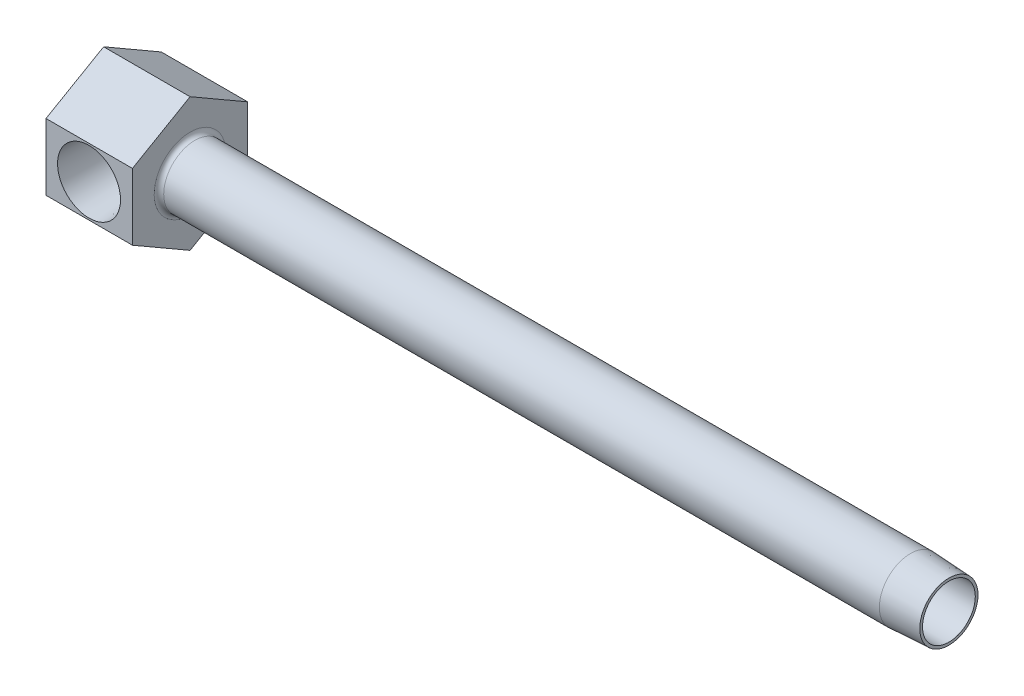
ISO-10303-21;
HEADER;
FILE_DESCRIPTION(('STEP AP214'),'2;1');
FILE_NAME('part.step','',(''),(''),'','','');
FILE_SCHEMA(('AUTOMOTIVE_DESIGN { 1 0 10303 214 1 1 1 1 }'));
ENDSEC;
DATA;
#1=APPLICATION_CONTEXT('core data for automotive mechanical design processes');
#2=APPLICATION_PROTOCOL_DEFINITION('international standard','automotive_design',2000,#1);
#3=PRODUCT_CONTEXT('',#1,'mechanical');
#4=PRODUCT('Part','Part','',(#3));
#5=PRODUCT_RELATED_PRODUCT_CATEGORY('part','',(#4));
#6=PRODUCT_DEFINITION_FORMATION('','',#4);
#7=PRODUCT_DEFINITION_CONTEXT('part definition',#1,'design');
#8=PRODUCT_DEFINITION('design','',#6,#7);
#9=PRODUCT_DEFINITION_SHAPE('','',#8);
#10=(LENGTH_UNIT() NAMED_UNIT(*) SI_UNIT(.MILLI.,.METRE.));
#11=(NAMED_UNIT(*) PLANE_ANGLE_UNIT() SI_UNIT($,.RADIAN.));
#12=(NAMED_UNIT(*) SI_UNIT($,.STERADIAN.) SOLID_ANGLE_UNIT());
#13=UNCERTAINTY_MEASURE_WITH_UNIT(LENGTH_MEASURE(1.E-05),#10,'distance_accuracy_value','');
#14=(GEOMETRIC_REPRESENTATION_CONTEXT(3) GLOBAL_UNCERTAINTY_ASSIGNED_CONTEXT((#13)) GLOBAL_UNIT_ASSIGNED_CONTEXT((#10,
#11,#12)) REPRESENTATION_CONTEXT('',''));
#15=CARTESIAN_POINT('',(0.,0.,0.));
#16=DIRECTION('',(0.,0.,1.));
#17=DIRECTION('',(1.,0.,0.));
#18=AXIS2_PLACEMENT_3D('',#15,#16,#17);
#19=CARTESIAN_POINT('',(7.14375,0.,9.525));
#20=DIRECTION('',(1.,0.,0.));
#21=DIRECTION('',(0.,0.,-1.));
#22=AXIS2_PLACEMENT_3D('',#19,#20,#21);
#23=PLANE('',#22);
#24=DIRECTION('',(0.,0.,1.));
#25=VECTOR('',#24,1.);
#26=CARTESIAN_POINT('',(7.14375,4.21628045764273,19.05));
#27=LINE('',#26,#25);
#28=CARTESIAN_POINT('',(7.14375,4.21628045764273,8.39289543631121));
#29=VERTEX_POINT('',#28);
#30=CARTESIAN_POINT('',(7.14375,4.21628045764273,10.16));
#31=VERTEX_POINT('',#30);
#32=EDGE_CURVE('E280',#29,#31,#27,.T.);
#33=ORIENTED_EDGE('',*,*,#32,.F.);
#34=CARTESIAN_POINT('',(7.14375,0.,9.525));
#35=DIRECTION('',(1.,0.,0.));
#36=DIRECTION('',(0.,0.,-1.));
#37=AXIS2_PLACEMENT_3D('',#34,#35,#36);
#38=CIRCLE('',#37,4.365625);
#39=CARTESIAN_POINT('',(7.14375,4.31919629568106,10.16));
#40=VERTEX_POINT('',#39);
#41=EDGE_CURVE('E163',#29,#40,#38,.T.);
#42=ORIENTED_EDGE('',*,*,#41,.T.);
#43=DIRECTION('',(0.,1.,0.));
#44=VECTOR('',#43,1.);
#45=CARTESIAN_POINT('',(7.14375,0.,10.16));
#46=LINE('',#45,#44);
#47=EDGE_CURVE('E153',#31,#40,#46,.T.);
#48=ORIENTED_EDGE('',*,*,#47,.F.);
#49=EDGE_LOOP('',(#33,#42,#48));
#50=FACE_BOUND('',#49,.T.);
#51=ADVANCED_FACE('F15',(#50),#23,.T.);
#52=CARTESIAN_POINT('',(14.2875,5.4992613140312,19.05));
#53=DIRECTION('',(0.,0.,-1.));
#54=DIRECTION('',(-1.,0.,0.));
#55=AXIS2_PLACEMENT_3D('',#52,#53,#54);
#56=PLANE('',#55);
#57=CARTESIAN_POINT('',(7.112,0.,19.05));
#58=DIRECTION('',(0.,0.,1.));
#59=DIRECTION('',(1.,0.,0.));
#60=AXIS2_PLACEMENT_3D('',#57,#58,#59);
#61=CIRCLE('',#60,5.2023645);
#62=CARTESIAN_POINT('',(12.3143645,0.,19.05));
#63=VERTEX_POINT('',#62);
#64=EDGE_CURVE('E269',#63,#63,#61,.T.);
#65=ORIENTED_EDGE('',*,*,#64,.F.);
#66=EDGE_LOOP('',(#65));
#67=FACE_BOUND('',#66,.T.);
#68=DIRECTION('',(0.,-1.,0.));
#69=VECTOR('',#68,1.);
#70=CARTESIAN_POINT('',(0.,5.4992613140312,19.05));
#71=LINE('',#70,#69);
#72=CARTESIAN_POINT('',(0.,5.4992613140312,19.05));
#73=VERTEX_POINT('',#72);
#74=CARTESIAN_POINT('',(0.,-5.49926131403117,19.05));
#75=VERTEX_POINT('',#74);
#76=EDGE_CURVE('E178',#73,#75,#71,.T.);
#77=ORIENTED_EDGE('',*,*,#76,.T.);
#78=DIRECTION('',(-1.,0.,0.));
#79=VECTOR('',#78,1.);
#80=CARTESIAN_POINT('',(14.2875,-5.49926131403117,19.05));
#81=LINE('',#80,#79);
#82=CARTESIAN_POINT('',(14.2875,-5.49926131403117,19.05));
#83=VERTEX_POINT('',#82);
#84=EDGE_CURVE('E201',#83,#75,#81,.T.);
#85=ORIENTED_EDGE('',*,*,#84,.F.);
#86=DIRECTION('',(0.,-1.,0.));
#87=VECTOR('',#86,1.);
#88=CARTESIAN_POINT('',(14.2875,5.4992613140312,19.05));
#89=LINE('',#88,#87);
#90=CARTESIAN_POINT('',(14.2875,5.4992613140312,19.05));
#91=VERTEX_POINT('',#90);
#92=EDGE_CURVE('E194',#91,#83,#89,.T.);
#93=ORIENTED_EDGE('',*,*,#92,.F.);
#94=DIRECTION('',(-1.,0.,0.));
#95=VECTOR('',#94,1.);
#96=CARTESIAN_POINT('',(14.2875,5.4992613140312,19.05));
#97=LINE('',#96,#95);
#98=EDGE_CURVE('E204',#91,#73,#97,.T.);
#99=ORIENTED_EDGE('',*,*,#98,.T.);
#100=EDGE_LOOP('',(#77,#85,#93,#99));
#101=FACE_BOUND('',#100,.T.);
#102=ADVANCED_FACE('F119',(#67,#101),#56,.F.);
#103=CARTESIAN_POINT('',(14.2875,-5.49926131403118,0.));
#104=DIRECTION('',(1.,0.,0.));
#105=DIRECTION('',(0.,1.,0.));
#106=AXIS2_PLACEMENT_3D('',#103,#104,#105);
#107=PLANE('',#106);
#108=CARTESIAN_POINT('',(14.2875,0.,9.525));
#109=DIRECTION('',(1.,0.,0.));
#110=DIRECTION('',(0.,1.,0.));
#111=AXIS2_PLACEMENT_3D('',#108,#109,#110);
#112=CIRCLE('',#111,5.9309);
#113=CARTESIAN_POINT('',(14.2875,5.9309,9.525));
#114=VERTEX_POINT('',#113);
#115=EDGE_CURVE('E216',#114,#114,#112,.F.);
#116=ORIENTED_EDGE('',*,*,#115,.T.);
#117=EDGE_LOOP('',(#116));
#118=FACE_BOUND('',#117,.T.);
#119=DIRECTION('',(0.,0.5,-0.866025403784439));
#120=VECTOR('',#119,1.);
#121=CARTESIAN_POINT('',(14.2875,-10.9985226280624,9.525));
#122=LINE('',#121,#120);
#123=CARTESIAN_POINT('',(14.2875,-10.9985226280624,9.525));
#124=VERTEX_POINT('',#123);
#125=CARTESIAN_POINT('',(14.2875,-5.49926131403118,0.));
#126=VERTEX_POINT('',#125);
#127=EDGE_CURVE('E184',#124,#126,#122,.T.);
#128=ORIENTED_EDGE('',*,*,#127,.T.);
#129=DIRECTION('',(0.,1.,0.));
#130=VECTOR('',#129,1.);
#131=CARTESIAN_POINT('',(14.2875,-5.49926131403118,0.));
#132=LINE('',#131,#130);
#133=CARTESIAN_POINT('',(14.2875,5.49926131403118,0.));
#134=VERTEX_POINT('',#133);
#135=EDGE_CURVE('E188',#126,#134,#132,.T.);
#136=ORIENTED_EDGE('',*,*,#135,.T.);
#137=DIRECTION('',(0.,0.5,0.866025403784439));
#138=VECTOR('',#137,1.);
#139=CARTESIAN_POINT('',(14.2875,5.49926131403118,0.));
#140=LINE('',#139,#138);
#141=CARTESIAN_POINT('',(14.2875,10.9985226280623,9.525));
#142=VERTEX_POINT('',#141);
#143=EDGE_CURVE('E190',#134,#142,#140,.T.);
#144=ORIENTED_EDGE('',*,*,#143,.T.);
#145=DIRECTION('',(0.,-0.5,0.86602540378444));
#146=VECTOR('',#145,1.);
#147=CARTESIAN_POINT('',(14.2875,10.9985226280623,9.525));
#148=LINE('',#147,#146);
#149=EDGE_CURVE('E192',#142,#91,#148,.T.);
#150=ORIENTED_EDGE('',*,*,#149,.T.);
#151=ORIENTED_EDGE('',*,*,#92,.T.);
#152=DIRECTION('',(0.,-0.5,-0.866025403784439));
#153=VECTOR('',#152,1.);
#154=CARTESIAN_POINT('',(14.2875,-5.49926131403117,19.05));
#155=LINE('',#154,#153);
#156=EDGE_CURVE('E38',#83,#124,#155,.T.);
#157=ORIENTED_EDGE('',*,*,#156,.T.);
#158=EDGE_LOOP('',(#128,#136,#144,#150,#151,#157));
#159=FACE_BOUND('',#158,.T.);
#160=ADVANCED_FACE('F127',(#118,#159),#107,.T.);
#161=CARTESIAN_POINT('',(14.2875,-10.9985226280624,9.525));
#162=DIRECTION('',(0.,0.866025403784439,0.5));
#163=DIRECTION('',(0.,-0.5,0.866025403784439));
#164=AXIS2_PLACEMENT_3D('',#161,#162,#163);
#165=PLANE('',#164);
#166=DIRECTION('',(0.,0.5,-0.866025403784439));
#167=VECTOR('',#166,1.);
#168=CARTESIAN_POINT('',(0.,-10.9985226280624,9.525));
#169=LINE('',#168,#167);
#170=CARTESIAN_POINT('',(0.,-10.9985226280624,9.525));
#171=VERTEX_POINT('',#170);
#172=CARTESIAN_POINT('',(0.,-5.49926131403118,0.));
#173=VERTEX_POINT('',#172);
#174=EDGE_CURVE('E166',#171,#173,#169,.T.);
#175=ORIENTED_EDGE('',*,*,#174,.T.);
#176=DIRECTION('',(-1.,0.,0.));
#177=VECTOR('',#176,1.);
#178=CARTESIAN_POINT('',(14.2875,-5.49926131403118,0.));
#179=LINE('',#178,#177);
#180=EDGE_CURVE('E213',#126,#173,#179,.T.);
#181=ORIENTED_EDGE('',*,*,#180,.F.);
#182=ORIENTED_EDGE('',*,*,#127,.F.);
#183=DIRECTION('',(-1.,0.,0.));
#184=VECTOR('',#183,1.);
#185=CARTESIAN_POINT('',(14.2875,-10.9985226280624,9.525));
#186=LINE('',#185,#184);
#187=EDGE_CURVE('E197',#124,#171,#186,.T.);
#188=ORIENTED_EDGE('',*,*,#187,.T.);
#189=EDGE_LOOP('',(#175,#181,#182,#188));
#190=FACE_BOUND('',#189,.T.);
#191=ADVANCED_FACE('F301',(#190),#165,.F.);
#192=CARTESIAN_POINT('',(14.2875,-5.49926131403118,0.));
#193=DIRECTION('',(0.,0.,1.));
#194=DIRECTION('',(0.,-1.,0.));
#195=AXIS2_PLACEMENT_3D('',#192,#193,#194);
#196=PLANE('',#195);
#197=DIRECTION('',(0.,1.,0.));
#198=VECTOR('',#197,1.);
#199=CARTESIAN_POINT('',(0.,-5.49926131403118,0.));
#200=LINE('',#199,#198);
#201=CARTESIAN_POINT('',(0.,5.49926131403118,0.));
#202=VERTEX_POINT('',#201);
#203=EDGE_CURVE('E169',#173,#202,#200,.T.);
#204=ORIENTED_EDGE('',*,*,#203,.T.);
#205=DIRECTION('',(-1.,0.,0.));
#206=VECTOR('',#205,1.);
#207=CARTESIAN_POINT('',(14.2875,5.49926131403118,0.));
#208=LINE('',#207,#206);
#209=EDGE_CURVE('E210',#134,#202,#208,.T.);
#210=ORIENTED_EDGE('',*,*,#209,.F.);
#211=ORIENTED_EDGE('',*,*,#135,.F.);
#212=ORIENTED_EDGE('',*,*,#180,.T.);
#213=EDGE_LOOP('',(#204,#210,#211,#212));
#214=FACE_BOUND('',#213,.T.);
#215=ADVANCED_FACE('F307',(#214),#196,.F.);
#216=CARTESIAN_POINT('',(14.2875,5.49926131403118,0.));
#217=DIRECTION('',(0.,-0.866025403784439,0.5));
#218=DIRECTION('',(0.,-0.5,-0.866025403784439));
#219=AXIS2_PLACEMENT_3D('',#216,#217,#218);
#220=PLANE('',#219);
#221=DIRECTION('',(0.,0.5,0.866025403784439));
#222=VECTOR('',#221,1.);
#223=CARTESIAN_POINT('',(0.,5.49926131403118,0.));
#224=LINE('',#223,#222);
#225=CARTESIAN_POINT('',(0.,10.9985226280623,9.525));
#226=VERTEX_POINT('',#225);
#227=EDGE_CURVE('E172',#202,#226,#224,.T.);
#228=ORIENTED_EDGE('',*,*,#227,.T.);
#229=DIRECTION('',(-1.,0.,0.));
#230=VECTOR('',#229,1.);
#231=CARTESIAN_POINT('',(14.2875,10.9985226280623,9.525));
#232=LINE('',#231,#230);
#233=EDGE_CURVE('E207',#142,#226,#232,.T.);
#234=ORIENTED_EDGE('',*,*,#233,.F.);
#235=ORIENTED_EDGE('',*,*,#143,.F.);
#236=ORIENTED_EDGE('',*,*,#209,.T.);
#237=EDGE_LOOP('',(#228,#234,#235,#236));
#238=FACE_BOUND('',#237,.T.);
#239=ADVANCED_FACE('F309',(#238),#220,.F.);
#240=CARTESIAN_POINT('',(14.2875,10.9985226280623,9.525));
#241=DIRECTION('',(0.,-0.86602540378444,-0.5));
#242=DIRECTION('',(0.,0.5,-0.86602540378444));
#243=AXIS2_PLACEMENT_3D('',#240,#241,#242);
#244=PLANE('',#243);
#245=DIRECTION('',(0.,-0.5,0.86602540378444));
#246=VECTOR('',#245,1.);
#247=CARTESIAN_POINT('',(0.,10.9985226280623,9.525));
#248=LINE('',#247,#246);
#249=EDGE_CURVE('E175',#226,#73,#248,.T.);
#250=ORIENTED_EDGE('',*,*,#249,.T.);
#251=ORIENTED_EDGE('',*,*,#98,.F.);
#252=ORIENTED_EDGE('',*,*,#149,.F.);
#253=ORIENTED_EDGE('',*,*,#233,.T.);
#254=EDGE_LOOP('',(#250,#251,#252,#253));
#255=FACE_BOUND('',#254,.T.);
#256=ADVANCED_FACE('F312',(#255),#244,.F.);
#257=CARTESIAN_POINT('',(14.2875,-5.49926131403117,19.05));
#258=DIRECTION('',(0.,0.866025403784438,-0.5));
#259=DIRECTION('',(0.,0.5,0.866025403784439));
#260=AXIS2_PLACEMENT_3D('',#257,#258,#259);
#261=PLANE('',#260);
#262=DIRECTION('',(0.,-0.5,-0.866025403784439));
#263=VECTOR('',#262,1.);
#264=CARTESIAN_POINT('',(0.,-5.49926131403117,19.05));
#265=LINE('',#264,#263);
#266=EDGE_CURVE('E181',#75,#171,#265,.T.);
#267=ORIENTED_EDGE('',*,*,#266,.T.);
#268=ORIENTED_EDGE('',*,*,#187,.F.);
#269=ORIENTED_EDGE('',*,*,#156,.F.);
#270=ORIENTED_EDGE('',*,*,#84,.T.);
#271=EDGE_LOOP('',(#267,#268,#269,#270));
#272=FACE_BOUND('',#271,.T.);
#273=ADVANCED_FACE('F296',(#272),#261,.F.);
#274=CARTESIAN_POINT('',(0.,-5.49926131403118,0.));
#275=DIRECTION('',(1.,0.,0.));
#276=DIRECTION('',(0.,1.,0.));
#277=AXIS2_PLACEMENT_3D('',#274,#275,#276);
#278=PLANE('',#277);
#279=ORIENTED_EDGE('',*,*,#174,.F.);
#280=ORIENTED_EDGE('',*,*,#266,.F.);
#281=ORIENTED_EDGE('',*,*,#76,.F.);
#282=ORIENTED_EDGE('',*,*,#249,.F.);
#283=ORIENTED_EDGE('',*,*,#227,.F.);
#284=ORIENTED_EDGE('',*,*,#203,.F.);
#285=EDGE_LOOP('',(#279,#280,#281,#282,#283,#284));
#286=FACE_BOUND('',#285,.T.);
#287=ADVANCED_FACE('F141',(#286),#278,.F.);
#288=CARTESIAN_POINT('',(68.0114010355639,0.,9.525));
#289=DIRECTION('',(-1.,0.,0.));
#290=DIRECTION('',(0.,0.,1.));
#291=AXIS2_PLACEMENT_3D('',#288,#289,#290);
#292=CYLINDRICAL_SURFACE('',#291,5.1435);
#293=CARTESIAN_POINT('',(133.35,0.,9.525));
#294=DIRECTION('',(-1.,0.,0.));
#295=DIRECTION('',(0.,0.,1.));
#296=AXIS2_PLACEMENT_3D('',#293,#294,#295);
#297=CIRCLE('',#296,5.1435);
#298=CARTESIAN_POINT('',(133.35,0.,14.6685));
#299=VERTEX_POINT('',#298);
#300=EDGE_CURVE('E10',#299,#299,#297,.F.);
#301=ORIENTED_EDGE('',*,*,#300,.F.);
#302=EDGE_LOOP('',(#301));
#303=FACE_BOUND('',#302,.T.);
#304=CARTESIAN_POINT('',(15.0749,0.,9.525));
#305=DIRECTION('',(1.,0.,0.));
#306=DIRECTION('',(0.,1.,0.));
#307=AXIS2_PLACEMENT_3D('',#304,#305,#306);
#308=CIRCLE('',#307,5.1435);
#309=CARTESIAN_POINT('',(15.0749,5.1435,9.525));
#310=VERTEX_POINT('',#309);
#311=EDGE_CURVE('E219',#310,#310,#308,.T.);
#312=ORIENTED_EDGE('',*,*,#311,.T.);
#313=EDGE_LOOP('',(#312));
#314=FACE_BOUND('',#313,.T.);
#315=ADVANCED_FACE('F17',(#303,#314),#292,.T.);
#316=CARTESIAN_POINT('',(7.14375,-4.31919629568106,10.16));
#317=VERTEX_POINT('',#316);
#318=CARTESIAN_POINT('',(7.14375,-4.21628045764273,10.16));
#319=VERTEX_POINT('',#318);
#320=EDGE_CURVE('E146',#317,#319,#46,.T.);
#321=ORIENTED_EDGE('',*,*,#320,.F.);
#322=CARTESIAN_POINT('',(7.14375,-4.21628045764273,8.39289543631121));
#323=VERTEX_POINT('',#322);
#324=EDGE_CURVE('E148',#317,#323,#38,.T.);
#325=ORIENTED_EDGE('',*,*,#324,.T.);
#326=DIRECTION('',(0.,0.,1.));
#327=VECTOR('',#326,1.);
#328=CARTESIAN_POINT('',(7.14375,-4.21628045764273,19.05));
#329=LINE('',#328,#327);
#330=EDGE_CURVE('E149',#319,#323,#329,.F.);
#331=ORIENTED_EDGE('',*,*,#330,.F.);
#332=EDGE_LOOP('',(#321,#325,#331));
#333=FACE_BOUND('',#332,.T.);
#334=ADVANCED_FACE('F122',(#333),#23,.T.);
#335=CARTESIAN_POINT('',(66.1375087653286,0.,9.525));
#336=DIRECTION('',(1.,0.,0.));
#337=DIRECTION('',(0.,0.,-1.));
#338=AXIS2_PLACEMENT_3D('',#335,#336,#337);
#339=CYLINDRICAL_SURFACE('',#338,4.365625);
#340=DIRECTION('',(1.,0.,0.));
#341=VECTOR('',#340,1.);
#342=CARTESIAN_POINT('',(66.1375087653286,4.31919629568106,10.16));
#343=LINE('',#342,#341);
#344=CARTESIAN_POINT('',(9.50166012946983,4.31919629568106,10.16));
#345=VERTEX_POINT('',#344);
#346=EDGE_CURVE('E23',#40,#345,#343,.T.);
#347=ORIENTED_EDGE('',*,*,#346,.F.);
#348=ORIENTED_EDGE('',*,*,#41,.F.);
#349=CARTESIAN_POINT('',(11.0152606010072,1.5945487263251,5.461));
#350=CARTESIAN_POINT('',(10.9690910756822,1.7075595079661,5.50534166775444));
#351=CARTESIAN_POINT('',(10.9186455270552,1.81703423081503,5.55373339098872));
#352=CARTESIAN_POINT('',(10.810302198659,2.02846645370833,5.65746242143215));
#353=CARTESIAN_POINT('',(10.7524192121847,2.13043826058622,5.71278593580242));
#354=CARTESIAN_POINT('',(10.5698905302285,2.42358040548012,5.88682744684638));
#355=CARTESIAN_POINT('',(10.4356317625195,2.6037024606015,6.01432367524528));
#356=CARTESIAN_POINT('',(10.2004726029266,2.87382153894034,6.2358690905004));
#357=CARTESIAN_POINT('',(10.1051285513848,2.97281573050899,6.32528321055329));
#358=CARTESIAN_POINT('',(9.90783434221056,3.15907014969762,6.50903483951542));
#359=CARTESIAN_POINT('',(9.80588273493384,3.2463277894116,6.60337342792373));
#360=CARTESIAN_POINT('',(9.59613587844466,3.40951469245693,6.79556583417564));
#361=CARTESIAN_POINT('',(9.48833347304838,3.48542963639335,6.89342390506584));
#362=CARTESIAN_POINT('',(9.26745878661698,3.62617881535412,7.09103053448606));
#363=CARTESIAN_POINT('',(9.15438825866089,3.69101670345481,7.19077845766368));
#364=CARTESIAN_POINT('',(8.91700112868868,3.81296593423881,7.39547820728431));
#365=CARTESIAN_POINT('',(8.79240497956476,3.86952009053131,7.50043788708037));
#366=CARTESIAN_POINT('',(8.53587575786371,3.97111492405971,7.70779573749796));
#367=CARTESIAN_POINT('',(8.40392330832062,4.01612325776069,7.81018600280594));
#368=CARTESIAN_POINT('',(8.16304729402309,4.0847277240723,7.98226690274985));
#369=CARTESIAN_POINT('',(8.0562781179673,4.11086974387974,8.05387458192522));
#370=CARTESIAN_POINT('',(7.89027521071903,4.14432560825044,8.15224503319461));
#371=CARTESIAN_POINT('',(7.83425575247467,4.15448196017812,8.18339689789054));
#372=CARTESIAN_POINT('',(7.71975817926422,4.17277321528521,8.24142733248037));
#373=CARTESIAN_POINT('',(7.6612817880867,4.18090950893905,8.26830883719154));
#374=CARTESIAN_POINT('',(7.52931857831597,4.19631734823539,8.32062856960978));
#375=CARTESIAN_POINT('',(7.45518069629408,4.2030846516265,8.34468558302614));
#376=CARTESIAN_POINT('',(7.30234246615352,4.21282137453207,8.37996487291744));
#377=CARTESIAN_POINT('',(7.22358315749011,4.21571837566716,8.39094201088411));
#378=CARTESIAN_POINT('',(7.14374999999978,4.21628045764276,8.39289543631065));
#379=B_SPLINE_CURVE_WITH_KNOTS('',3,(#349,#350,#351,#352,#353,#354,#355,#356,#357,#358,#359,
#360,#361,#362,#363,#364,#365,#366,#367,#368,#369,#370,#371,#372,#373,#374,#375,#376,#377,#378),
.UNSPECIFIED.,.F.,.F.,(4,2,2,2,2,2,2,2,2,2,2,2,2,2,4),(0.,0.389178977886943,0.777595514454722,
1.54850925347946,2.03989074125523,2.5313804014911,3.02348538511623,3.51542776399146,
4.03226982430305,4.5505442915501,4.94339994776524,5.13792303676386,5.33231185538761,
5.56585330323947,5.80370611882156),.UNSPECIFIED.);
#380=CARTESIAN_POINT('',(11.0152606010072,1.5945487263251,5.461));
#381=VERTEX_POINT('',#380);
#382=EDGE_CURVE('E222',#381,#29,#379,.T.);
#383=ORIENTED_EDGE('',*,*,#382,.F.);
#384=CARTESIAN_POINT('',(11.038608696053,-1.66986531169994,5.4913625));
#385=CARTESIAN_POINT('',(11.0105354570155,-1.5831922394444,5.45544731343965));
#386=CARTESIAN_POINT('',(10.985979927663,-1.49442111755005,5.422003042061));
#387=CARTESIAN_POINT('',(10.9431209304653,-1.31365154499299,5.36062405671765));
#388=CARTESIAN_POINT('',(10.9248095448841,-1.22165734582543,5.3326823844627));
#389=CARTESIAN_POINT('',(10.8936059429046,-1.03529168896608,5.28281066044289));
#390=CARTESIAN_POINT('',(10.8807075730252,-0.94092306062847,5.26087379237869));
#391=CARTESIAN_POINT('',(10.8594086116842,-0.750424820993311,5.22325970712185));
#392=CARTESIAN_POINT('',(10.8510094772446,-0.654294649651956,5.20758451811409));
#393=CARTESIAN_POINT('',(10.8381415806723,-0.463156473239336,5.18296779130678));
#394=CARTESIAN_POINT('',(10.8335877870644,-0.368172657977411,5.1738812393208));
#395=CARTESIAN_POINT('',(10.8276558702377,-0.177678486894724,5.16194794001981));
#396=CARTESIAN_POINT('',(10.8262790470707,-0.0821679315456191,5.15910374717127));
#397=CARTESIAN_POINT('',(10.826564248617,0.108822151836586,5.15968693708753));
#398=CARTESIAN_POINT('',(10.828226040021,0.204301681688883,5.16311383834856));
#399=CARTESIAN_POINT('',(10.8347557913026,0.3946850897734,5.17620642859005));
#400=CARTESIAN_POINT('',(10.8396224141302,0.489589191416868,5.18586951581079));
#401=CARTESIAN_POINT('',(10.8530224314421,0.678329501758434,5.2113452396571));
#402=CARTESIAN_POINT('',(10.861556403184,0.772165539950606,5.22715884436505));
#403=CARTESIAN_POINT('',(10.882977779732,0.958108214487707,5.26475262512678));
#404=CARTESIAN_POINT('',(10.8958637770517,1.05021539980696,5.28653087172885));
#405=CARTESIAN_POINT('',(10.9268394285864,1.23213175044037,5.33579934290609));
#406=CARTESIAN_POINT('',(10.9449350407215,1.32193815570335,5.36329609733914));
#407=CARTESIAN_POINT('',(10.9870994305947,1.49845562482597,5.42352620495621));
#408=CARTESIAN_POINT('',(11.0111754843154,1.58516276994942,5.45626591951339));
#409=CARTESIAN_POINT('',(11.038608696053,1.66986531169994,5.4913625));
#410=B_SPLINE_CURVE_WITH_KNOTS('',3,(#384,#385,#386,#387,#388,#389,#390,#391,#392,#393,#394,
#395,#396,#397,#398,#399,#400,#401,#402,#403,#404,#405,#406,#407,#408,#409),.UNSPECIFIED.,.F.,
.F.,(4,2,2,2,2,2,2,2,2,2,2,2,4),(0.,0.293591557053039,0.586809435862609,0.879693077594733,
1.17267150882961,1.45898777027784,1.74542117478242,2.03183258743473,2.31812458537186,
2.60446166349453,2.89070622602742,3.17727945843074,3.46420306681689),.UNSPECIFIED.);
#411=CARTESIAN_POINT('',(11.0152606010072,-1.5945487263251,5.461));
#412=VERTEX_POINT('',#411);
#413=EDGE_CURVE('E227',#412,#381,#410,.T.);
#414=ORIENTED_EDGE('',*,*,#413,.F.);
#415=CARTESIAN_POINT('',(7.14375,-4.21628045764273,8.39289543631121));
#416=CARTESIAN_POINT('',(7.18362399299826,-4.21598583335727,8.39181806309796));
#417=CARTESIAN_POINT('',(7.22338201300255,-4.21511517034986,8.38855660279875));
#418=CARTESIAN_POINT('',(7.30220974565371,-4.21229002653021,8.3781194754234));
#419=CARTESIAN_POINT('',(7.34128135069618,-4.21033927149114,8.37095726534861));
#420=CARTESIAN_POINT('',(7.45558593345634,-4.20306181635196,8.34463096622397));
#421=CARTESIAN_POINT('',(7.52959005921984,-4.19629141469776,8.32054287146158));
#422=CARTESIAN_POINT('',(7.67793141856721,-4.17895935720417,8.2616842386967));
#423=CARTESIAN_POINT('',(7.75200183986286,-4.16818767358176,8.22634138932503));
#424=CARTESIAN_POINT('',(7.89635080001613,-4.14345087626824,8.14945009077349));
#425=CARTESIAN_POINT('',(7.96662283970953,-4.12948049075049,8.10789143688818));
#426=CARTESIAN_POINT('',(8.10525974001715,-4.09836535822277,8.02024615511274));
#427=CARTESIAN_POINT('',(8.17357097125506,-4.08117012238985,7.97409391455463));
#428=CARTESIAN_POINT('',(8.30769836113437,-4.04390532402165,7.87936489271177));
#429=CARTESIAN_POINT('',(8.37351346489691,-4.02383456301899,7.83078710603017));
#430=CARTESIAN_POINT('',(8.57859672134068,-3.95588469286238,7.67482924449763));
#431=CARTESIAN_POINT('',(8.71418056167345,-3.90283307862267,7.56482866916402));
#432=CARTESIAN_POINT('',(8.97841531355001,-3.78358080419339,7.34346052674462));
#433=CARTESIAN_POINT('',(9.10705932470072,-3.71736735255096,7.23209172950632));
#434=CARTESIAN_POINT('',(9.35705912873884,-3.57190642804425,7.01153592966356));
#435=CARTESIAN_POINT('',(9.47845600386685,-3.49274436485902,6.90233956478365));
#436=CARTESIAN_POINT('',(9.71438396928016,-3.32067953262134,6.68762551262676));
#437=CARTESIAN_POINT('',(9.82891987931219,-3.22778657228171,6.58210526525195));
#438=CARTESIAN_POINT('',(10.0969445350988,-2.98549279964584,6.33327532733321));
#439=CARTESIAN_POINT('',(10.2465325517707,-2.82876640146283,6.19275827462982));
#440=CARTESIAN_POINT('',(10.5251240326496,-2.48539491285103,5.92944140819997));
#441=CARTESIAN_POINT('',(10.6541872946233,-2.29884003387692,5.80659022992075));
#442=CARTESIAN_POINT('',(10.815064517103,-2.01834728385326,5.65289947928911));
#443=CARTESIAN_POINT('',(10.8584525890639,-1.93670806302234,5.61137999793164));
#444=CARTESIAN_POINT('',(10.9405236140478,-1.76894321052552,5.53274400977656));
#445=CARTESIAN_POINT('',(10.9792015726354,-1.6828129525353,5.49563217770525));
#446=CARTESIAN_POINT('',(11.0152606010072,-1.5945487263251,5.461));
#447=B_SPLINE_CURVE_WITH_KNOTS('',3,(#415,#416,#417,#418,#419,#420,#421,#422,#423,#424,#425,
#426,#427,#428,#429,#430,#431,#432,#433,#434,#435,#436,#437,#438,#439,#440,#441,#442,#443,#444,
#445,#446),.UNSPECIFIED.,.F.,.F.,(4,2,2,2,2,2,2,2,2,2,2,2,2,2,2,4),(0.,0.119524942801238,
0.238640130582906,0.471907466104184,0.719716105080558,0.967936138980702,1.2204276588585,
1.47302472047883,2.01967972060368,2.56686861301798,3.1105838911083,3.65391262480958,
4.4259772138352,5.19574951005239,5.49953103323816,5.80363192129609),.UNSPECIFIED.);
#448=EDGE_CURVE('E162',#323,#412,#447,.T.);
#449=ORIENTED_EDGE('',*,*,#448,.F.);
#450=ORIENTED_EDGE('',*,*,#324,.F.);
#451=DIRECTION('',(1.,0.,0.));
#452=VECTOR('',#451,1.);
#453=CARTESIAN_POINT('',(66.1375087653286,-4.31919629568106,10.16));
#454=LINE('',#453,#452);
#455=CARTESIAN_POINT('',(9.50166012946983,-4.31919629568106,10.16));
#456=VERTEX_POINT('',#455);
#457=EDGE_CURVE('E160',#456,#317,#454,.F.);
#458=ORIENTED_EDGE('',*,*,#457,.F.);
#459=CARTESIAN_POINT('',(9.50159462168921,4.31922569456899,10.1598));
#460=CARTESIAN_POINT('',(9.52205476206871,4.31004461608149,10.2222542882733));
#461=CARTESIAN_POINT('',(9.54440879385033,4.29961032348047,10.2838517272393));
#462=CARTESIAN_POINT('',(9.592244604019,4.27639816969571,10.4052958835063));
#463=CARTESIAN_POINT('',(9.61772301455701,4.26362282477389,10.4651444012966));
#464=CARTESIAN_POINT('',(9.6977084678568,4.22211002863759,10.641720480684));
#465=CARTESIAN_POINT('',(9.75594525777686,4.19010742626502,10.7559937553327));
#466=CARTESIAN_POINT('',(9.87844694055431,4.11827910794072,10.9783012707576));
#467=CARTESIAN_POINT('',(9.94270165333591,4.07846648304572,11.0863455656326));
#468=CARTESIAN_POINT('',(10.0748723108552,3.9913538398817,11.2972300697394));
#469=CARTESIAN_POINT('',(10.1427929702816,3.94404402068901,11.4000632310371));
#470=CARTESIAN_POINT('',(10.298774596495,3.82856370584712,11.6276502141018));
#471=CARTESIAN_POINT('',(10.3873705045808,3.75819622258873,11.7509249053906));
#472=CARTESIAN_POINT('',(10.5646676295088,3.60591330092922,11.9899830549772));
#473=CARTESIAN_POINT('',(10.6533688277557,3.52399966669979,12.1057676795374));
#474=CARTESIAN_POINT('',(10.828903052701,3.34837324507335,12.3298815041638));
#475=CARTESIAN_POINT('',(10.9157338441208,3.25464716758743,12.4382020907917));
#476=CARTESIAN_POINT('',(11.0854790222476,3.05533823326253,12.6465978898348));
#477=CARTESIAN_POINT('',(11.1683947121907,2.94975936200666,12.746675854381));
#478=CARTESIAN_POINT('',(11.3637298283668,2.67738871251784,12.9797077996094));
#479=CARTESIAN_POINT('',(11.4730979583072,2.50408908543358,13.1077769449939));
#480=CARTESIAN_POINT('',(11.6736784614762,2.13317678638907,13.3402290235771));
#481=CARTESIAN_POINT('',(11.764930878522,1.93561933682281,13.444664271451));
#482=CARTESIAN_POINT('',(11.9092563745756,1.55445058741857,13.608817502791));
#483=CARTESIAN_POINT('',(11.9662034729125,1.37434002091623,13.6731460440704));
#484=CARTESIAN_POINT('',(12.036275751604,1.09545803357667,13.7520594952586));
#485=CARTESIAN_POINT('',(12.0570798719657,1.00100886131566,13.7754393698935));
#486=CARTESIAN_POINT('',(12.093196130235,0.80976989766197,13.8159777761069));
#487=CARTESIAN_POINT('',(12.1085105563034,0.712981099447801,13.8331388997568));
#488=CARTESIAN_POINT('',(12.1334016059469,0.517219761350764,13.861011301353));
#489=CARTESIAN_POINT('',(12.1429475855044,0.418238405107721,13.8716881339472));
#490=CARTESIAN_POINT('',(12.1559671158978,0.219418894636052,13.8862461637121));
#491=CARTESIAN_POINT('',(12.159443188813,0.119581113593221,13.8901301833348));
#492=CARTESIAN_POINT('',(12.1602489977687,-0.0801622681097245,13.8910308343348));
#493=CARTESIAN_POINT('',(12.157578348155,-0.180067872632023,13.8880470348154));
#494=CARTESIAN_POINT('',(12.1461610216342,-0.379063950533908,13.87528173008));
#495=CARTESIAN_POINT('',(12.1374146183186,-0.478154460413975,13.8655005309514));
#496=CARTESIAN_POINT('',(12.1041501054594,-0.757548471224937,13.8282625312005));
#497=CARTESIAN_POINT('',(12.0725539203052,-0.936048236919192,13.7928583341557));
#498=CARTESIAN_POINT('',(11.9914510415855,-1.28332325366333,13.701614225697));
#499=CARTESIAN_POINT('',(11.9419389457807,-1.45209555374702,13.645768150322));
#500=CARTESIAN_POINT('',(11.8234161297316,-1.78986703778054,13.5113020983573));
#501=CARTESIAN_POINT('',(11.7531886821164,-1.95786359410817,13.4312490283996));
#502=CARTESIAN_POINT('',(11.5990616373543,-2.2774775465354,13.2539727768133));
#503=CARTESIAN_POINT('',(11.515160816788,-2.42909347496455,13.1567480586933));
#504=CARTESIAN_POINT('',(11.2893838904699,-2.79222476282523,12.8919364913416));
#505=CARTESIAN_POINT('',(11.1405152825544,-2.99235864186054,12.7145443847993));
#506=CARTESIAN_POINT('',(10.9077049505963,-3.26312100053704,12.4281267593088));
#507=CARTESIAN_POINT('',(10.8282461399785,-3.34869576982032,12.3289140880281));
#508=CARTESIAN_POINT('',(10.6676325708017,-3.51003537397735,12.1240974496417));
#509=CARTESIAN_POINT('',(10.5864785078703,-3.58580414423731,12.0184960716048));
#510=CARTESIAN_POINT('',(10.4220303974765,-3.72941202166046,11.798300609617));
#511=CARTESIAN_POINT('',(10.338734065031,-3.79700254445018,11.6835467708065));
#512=CARTESIAN_POINT('',(10.1740816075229,-3.92201333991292,11.4470806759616));
#513=CARTESIAN_POINT('',(10.092727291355,-3.97942442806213,11.3253622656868));
#514=CARTESIAN_POINT('',(9.93568225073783,-4.08324264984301,11.0754774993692));
#515=CARTESIAN_POINT('',(9.85994825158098,-4.12974154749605,10.9473767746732));
#516=CARTESIAN_POINT('',(9.71779756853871,-4.21155620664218,10.6828322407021));
#517=CARTESIAN_POINT('',(9.65135922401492,-4.24689821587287,10.5464089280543));
#518=CARTESIAN_POINT('',(9.57628126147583,-4.28419371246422,10.3652627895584));
#519=CARTESIAN_POINT('',(9.56028735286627,-4.29194911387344,10.3247361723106));
#520=CARTESIAN_POINT('',(9.52977406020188,-4.30640007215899,10.2428664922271));
#521=CARTESIAN_POINT('',(9.51525722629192,-4.31309380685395,10.2015221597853));
#522=CARTESIAN_POINT('',(9.50159462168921,-4.31922569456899,10.1598));
#523=B_SPLINE_CURVE_WITH_KNOTS('',3,(#459,#460,#461,#462,#463,#464,#465,#466,#467,#468,#469,
#470,#471,#472,#473,#474,#475,#476,#477,#478,#479,#480,#481,#482,#483,#484,#485,#486,#487,#488,
#489,#490,#491,#492,#493,#494,#495,#496,#497,#498,#499,#500,#501,#502,#503,#504,#505,#506,#507,
#508,#509,#510,#511,#512,#513,#514,#515,#516,#517,#518,#519,#520,#521,#522),.UNSPECIFIED.,.F.,
.F.,(4,2,2,2,2,2,2,2,2,2,2,2,2,2,2,2,2,2,2,2,2,2,2,2,2,2,2,2,2,2,2,4),(0.,0.19895577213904,
0.397698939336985,0.793542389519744,1.1887279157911,1.58443438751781,2.08580736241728,
2.58710208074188,3.08896592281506,3.5906615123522,4.3128774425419,5.03347872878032,
5.62940645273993,5.92758657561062,6.22564226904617,6.52526772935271,6.82476866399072,
7.12428839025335,7.4237946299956,7.97525228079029,8.52687635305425,9.12138980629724,
9.71595648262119,10.6287987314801,11.0881817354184,11.5473798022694,12.018174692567,
12.4893922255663,12.9564924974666,13.4224855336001,13.5552077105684,13.6881552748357),.UNSPECIFIED.);
#524=EDGE_CURVE('E241',#345,#456,#523,.T.);
#525=ORIENTED_EDGE('',*,*,#524,.F.);
#526=EDGE_LOOP('',(#347,#348,#383,#414,#449,#450,#458,#525));
#527=FACE_BOUND('',#526,.T.);
#528=CARTESIAN_POINT('',(139.7,0.,9.525));
#529=DIRECTION('',(1.,0.,0.));
#530=DIRECTION('',(0.,0.,-1.));
#531=AXIS2_PLACEMENT_3D('',#528,#529,#530);
#532=CIRCLE('',#531,4.365625);
#533=CARTESIAN_POINT('',(139.7,0.,5.159375));
#534=VERTEX_POINT('',#533);
#535=EDGE_CURVE('E267',#534,#534,#532,.T.);
#536=ORIENTED_EDGE('',*,*,#535,.T.);
#537=EDGE_LOOP('',(#536));
#538=FACE_BOUND('',#537,.T.);
#539=ADVANCED_FACE('F114',(#527,#538),#339,.F.);
#540=CARTESIAN_POINT('',(15.0749,0.,9.525));
#541=DIRECTION('',(1.,0.,0.));
#542=DIRECTION('',(0.,1.,0.));
#543=AXIS2_PLACEMENT_3D('',#540,#541,#542);
#544=TOROIDAL_SURFACE('',#543,5.9309,0.7874);
#545=ORIENTED_EDGE('',*,*,#311,.F.);
#546=EDGE_LOOP('',(#545));
#547=FACE_BOUND('',#546,.T.);
#548=ORIENTED_EDGE('',*,*,#115,.F.);
#549=EDGE_LOOP('',(#548));
#550=FACE_BOUND('',#549,.T.);
#551=ADVANCED_FACE('F103',(#547,#550),#544,.F.);
#552=CARTESIAN_POINT('',(7.112,0.,5.461));
#553=DIRECTION('',(0.,0.,1.));
#554=DIRECTION('',(1.,0.,0.));
#555=AXIS2_PLACEMENT_3D('',#552,#553,#554);
#556=CONICAL_SURFACE('',#555,4.2164,1.02974425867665);
#557=ORIENTED_EDGE('',*,*,#413,.T.);
#558=CARTESIAN_POINT('',(7.112,0.,5.461));
#559=DIRECTION('',(0.,0.,1.));
#560=DIRECTION('',(1.,0.,0.));
#561=AXIS2_PLACEMENT_3D('',#558,#559,#560);
#562=CIRCLE('',#561,4.2164);
#563=EDGE_CURVE('E30',#381,#412,#562,.T.);
#564=ORIENTED_EDGE('',*,*,#563,.T.);
#565=EDGE_LOOP('',(#557,#564));
#566=FACE_BOUND('',#565,.T.);
#567=CARTESIAN_POINT('',(7.112,0.,2.92753128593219));
#568=VERTEX_POINT('',#567);
#569=VERTEX_LOOP('',#568);
#570=FACE_BOUND('',#569,.T.);
#571=ADVANCED_FACE('F100',(#566,#570),#556,.F.);
#572=CARTESIAN_POINT('',(7.112,0.,19.05));
#573=DIRECTION('',(0.,0.,1.));
#574=DIRECTION('',(1.,0.,0.));
#575=AXIS2_PLACEMENT_3D('',#572,#573,#574);
#576=CYLINDRICAL_SURFACE('',#575,4.2164);
#577=ORIENTED_EDGE('',*,*,#330,.T.);
#578=ORIENTED_EDGE('',*,*,#448,.T.);
#579=ORIENTED_EDGE('',*,*,#563,.F.);
#580=ORIENTED_EDGE('',*,*,#382,.T.);
#581=ORIENTED_EDGE('',*,*,#32,.T.);
#582=CARTESIAN_POINT('',(7.112,0.,10.16));
#583=DIRECTION('',(0.,0.,1.));
#584=DIRECTION('',(1.,0.,0.));
#585=AXIS2_PLACEMENT_3D('',#582,#583,#584);
#586=CIRCLE('',#585,4.2164);
#587=EDGE_CURVE('E277',#31,#319,#586,.T.);
#588=ORIENTED_EDGE('',*,*,#587,.T.);
#589=EDGE_LOOP('',(#577,#578,#579,#580,#581,#588));
#590=FACE_BOUND('',#589,.T.);
#591=ADVANCED_FACE('F102',(#590),#576,.F.);
#592=CARTESIAN_POINT('',(11.3284,0.,10.16));
#593=DIRECTION('',(0.,0.,-1.));
#594=DIRECTION('',(-1.,0.,0.));
#595=AXIS2_PLACEMENT_3D('',#592,#593,#594);
#596=PLANE('',#595);
#597=ORIENTED_EDGE('',*,*,#47,.T.);
#598=ORIENTED_EDGE('',*,*,#346,.T.);
#599=CARTESIAN_POINT('',(7.112,0.,10.16));
#600=DIRECTION('',(0.,0.,1.));
#601=DIRECTION('',(1.,0.,0.));
#602=AXIS2_PLACEMENT_3D('',#599,#600,#601);
#603=CIRCLE('',#602,4.93618599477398);
#604=EDGE_CURVE('E274',#345,#456,#603,.T.);
#605=ORIENTED_EDGE('',*,*,#604,.T.);
#606=ORIENTED_EDGE('',*,*,#457,.T.);
#607=ORIENTED_EDGE('',*,*,#320,.T.);
#608=ORIENTED_EDGE('',*,*,#587,.F.);
#609=EDGE_LOOP('',(#597,#598,#605,#606,#607,#608));
#610=FACE_BOUND('',#609,.T.);
#611=ADVANCED_FACE('F112',(#610),#596,.F.);
#612=CARTESIAN_POINT('',(7.112,0.,19.05));
#613=DIRECTION('',(0.,0.,1.));
#614=DIRECTION('',(1.,0.,0.));
#615=AXIS2_PLACEMENT_3D('',#612,#613,#614);
#616=CONICAL_SURFACE('',#615,5.2023645,0.0299323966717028);
#617=ORIENTED_EDGE('',*,*,#524,.T.);
#618=ORIENTED_EDGE('',*,*,#604,.F.);
#619=EDGE_LOOP('',(#617,#618));
#620=FACE_BOUND('',#619,.T.);
#621=ORIENTED_EDGE('',*,*,#64,.T.);
#622=EDGE_LOOP('',(#621));
#623=FACE_BOUND('',#622,.T.);
#624=ADVANCED_FACE('F246',(#620,#623),#616,.F.);
#625=CARTESIAN_POINT('',(139.7,0.,9.525));
#626=DIRECTION('',(-1.,0.,0.));
#627=DIRECTION('',(0.,0.,1.));
#628=AXIS2_PLACEMENT_3D('',#625,#626,#627);
#629=CONICAL_SURFACE('',#628,4.81071060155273,0.052359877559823);
#630=ORIENTED_EDGE('',*,*,#300,.T.);
#631=EDGE_LOOP('',(#630));
#632=FACE_BOUND('',#631,.T.);
#633=CARTESIAN_POINT('',(139.7,0.,9.525));
#634=DIRECTION('',(1.,0.,0.));
#635=DIRECTION('',(0.,0.,-1.));
#636=AXIS2_PLACEMENT_3D('',#633,#634,#635);
#637=CIRCLE('',#636,4.81071060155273);
#638=CARTESIAN_POINT('',(139.7,0.,4.71428939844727));
#639=VERTEX_POINT('',#638);
#640=EDGE_CURVE('E264',#639,#639,#637,.T.);
#641=ORIENTED_EDGE('',*,*,#640,.F.);
#642=EDGE_LOOP('',(#641));
#643=FACE_BOUND('',#642,.T.);
#644=ADVANCED_FACE('F250',(#632,#643),#629,.T.);
#645=CARTESIAN_POINT('',(139.7,0.,5.159375));
#646=DIRECTION('',(1.,0.,0.));
#647=DIRECTION('',(0.,0.,-1.));
#648=AXIS2_PLACEMENT_3D('',#645,#646,#647);
#649=PLANE('',#648);
#650=ORIENTED_EDGE('',*,*,#640,.T.);
#651=EDGE_LOOP('',(#650));
#652=FACE_BOUND('',#651,.T.);
#653=ORIENTED_EDGE('',*,*,#535,.F.);
#654=EDGE_LOOP('',(#653));
#655=FACE_BOUND('',#654,.T.);
#656=ADVANCED_FACE('F254',(#652,#655),#649,.T.);
#657=CLOSED_SHELL('',(#51,#102,#160,#191,#215,#239,#256,#273,#287,#315,#334,#539,#551,#571,#591,
#611,#624,#644,#656));
#658=MANIFOLD_SOLID_BREP('B1',#657);
#659=ADVANCED_BREP_SHAPE_REPRESENTATION('',(#18,#658),#14);
#660=SHAPE_DEFINITION_REPRESENTATION(#9,#659);
ENDSEC;
END-ISO-10303-21;
